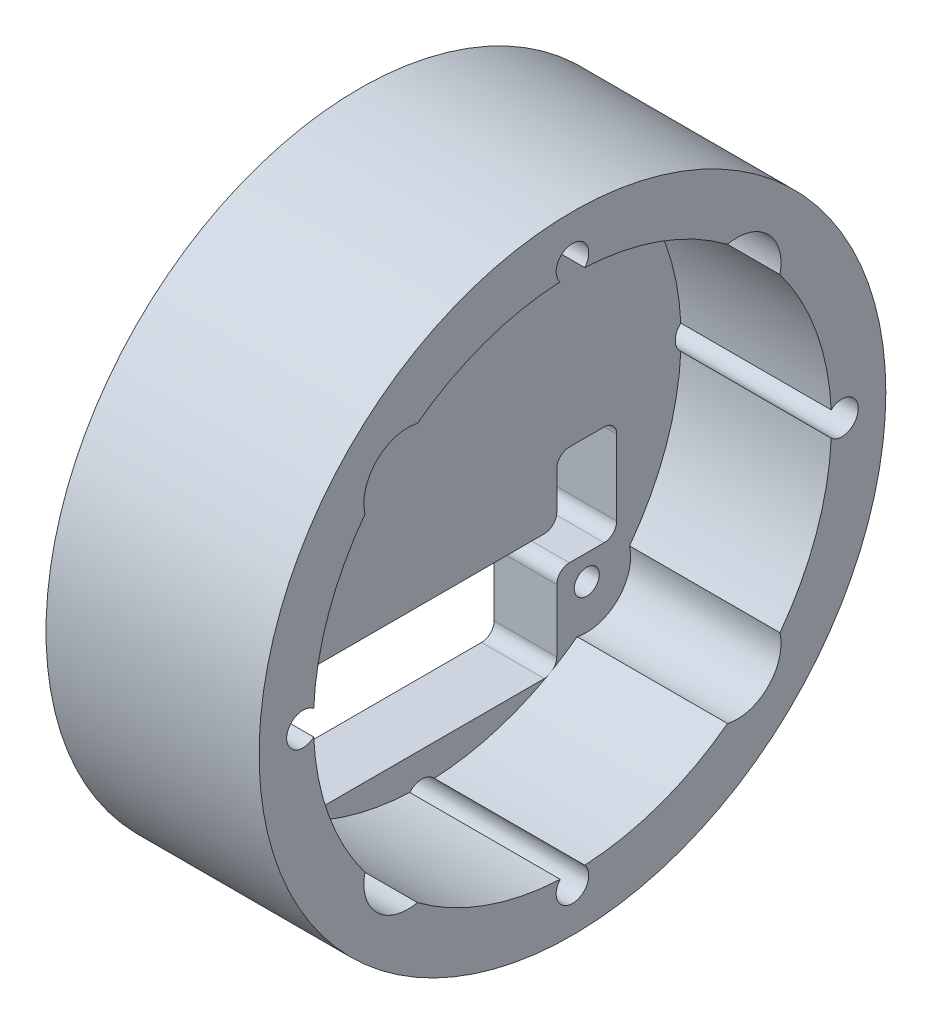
ISO-10303-21;
HEADER;
FILE_DESCRIPTION(('STEP AP214'),'2;1');
FILE_NAME('part.step','',(''),(''),'','','');
FILE_SCHEMA(('AUTOMOTIVE_DESIGN { 1 0 10303 214 1 1 1 1 }'));
ENDSEC;
DATA;
#1=APPLICATION_CONTEXT('core data for automotive mechanical design processes');
#2=APPLICATION_PROTOCOL_DEFINITION('international standard','automotive_design',2000,#1);
#3=PRODUCT_CONTEXT('',#1,'mechanical');
#4=PRODUCT('Part','Part','',(#3));
#5=PRODUCT_RELATED_PRODUCT_CATEGORY('part','',(#4));
#6=PRODUCT_DEFINITION_FORMATION('','',#4);
#7=PRODUCT_DEFINITION_CONTEXT('part definition',#1,'design');
#8=PRODUCT_DEFINITION('design','',#6,#7);
#9=PRODUCT_DEFINITION_SHAPE('','',#8);
#10=(LENGTH_UNIT() NAMED_UNIT(*) SI_UNIT(.MILLI.,.METRE.));
#11=(NAMED_UNIT(*) PLANE_ANGLE_UNIT() SI_UNIT($,.RADIAN.));
#12=(NAMED_UNIT(*) SI_UNIT($,.STERADIAN.) SOLID_ANGLE_UNIT());
#13=UNCERTAINTY_MEASURE_WITH_UNIT(LENGTH_MEASURE(1.E-05),#10,'distance_accuracy_value','');
#14=(GEOMETRIC_REPRESENTATION_CONTEXT(3) GLOBAL_UNCERTAINTY_ASSIGNED_CONTEXT((#13)) GLOBAL_UNIT_ASSIGNED_CONTEXT((#10,
#11,#12)) REPRESENTATION_CONTEXT('',''));
#15=CARTESIAN_POINT('',(0.,0.,0.));
#16=DIRECTION('',(0.,0.,1.));
#17=DIRECTION('',(1.,0.,0.));
#18=AXIS2_PLACEMENT_3D('',#15,#16,#17);
#19=CARTESIAN_POINT('',(17.,0.,0.));
#20=DIRECTION('',(-1.,0.,0.));
#21=DIRECTION('',(0.,0.,1.));
#22=AXIS2_PLACEMENT_3D('',#19,#20,#21);
#23=CYLINDRICAL_SURFACE('',#22,20.6666666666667);
#24=CARTESIAN_POINT('',(17.,0.,0.));
#25=DIRECTION('',(1.,0.,0.));
#26=DIRECTION('',(0.,0.,-1.));
#27=AXIS2_PLACEMENT_3D('',#24,#25,#26);
#28=CIRCLE('',#27,20.6666666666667);
#29=CARTESIAN_POINT('',(17.,0.977973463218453,-20.6435142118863));
#30=VERTEX_POINT('',#29);
#31=CARTESIAN_POINT('',(17.,12.3715848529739,-16.5546065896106));
#32=VERTEX_POINT('',#31);
#33=EDGE_CURVE('E366',#30,#32,#28,.T.);
#34=ORIENTED_EDGE('',*,*,#33,.T.);
#35=DIRECTION('',(-1.,0.,0.));
#36=VECTOR('',#35,1.);
#37=CARTESIAN_POINT('',(11.,12.3715848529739,-16.5546065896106));
#38=LINE('',#37,#36);
#39=CARTESIAN_POINT('',(5.,12.3715848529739,-16.5546065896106));
#40=VERTEX_POINT('',#39);
#41=EDGE_CURVE('E434',#32,#40,#38,.T.);
#42=ORIENTED_EDGE('',*,*,#41,.T.);
#43=CARTESIAN_POINT('',(5.,0.,0.));
#44=DIRECTION('',(1.,0.,0.));
#45=DIRECTION('',(0.,0.,-1.));
#46=AXIS2_PLACEMENT_3D('',#43,#44,#45);
#47=CIRCLE('',#46,20.6666666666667);
#48=CARTESIAN_POINT('',(5.,0.977973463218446,-20.6435142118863));
#49=VERTEX_POINT('',#48);
#50=EDGE_CURVE('E279',#49,#40,#47,.T.);
#51=ORIENTED_EDGE('',*,*,#50,.F.);
#52=DIRECTION('',(1.,0.,0.));
#53=VECTOR('',#52,1.);
#54=CARTESIAN_POINT('',(8.5,0.977973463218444,-20.6435142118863));
#55=LINE('',#54,#53);
#56=EDGE_CURVE('E335',#30,#49,#55,.F.);
#57=ORIENTED_EDGE('',*,*,#56,.F.);
#58=EDGE_LOOP('',(#34,#42,#51,#57));
#59=FACE_BOUND('',#58,.T.);
#60=ADVANCED_FACE('F34',(#59),#23,.F.);
#61=CARTESIAN_POINT('',(5.,16.554606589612,-12.371584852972));
#62=VERTEX_POINT('',#61);
#63=CARTESIAN_POINT('',(5.,20.6435142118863,-0.977973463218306));
#64=VERTEX_POINT('',#63);
#65=EDGE_CURVE('E276',#62,#64,#47,.T.);
#66=ORIENTED_EDGE('',*,*,#65,.F.);
#67=DIRECTION('',(-1.,0.,0.));
#68=VECTOR('',#67,1.);
#69=CARTESIAN_POINT('',(11.,16.554606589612,-12.371584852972));
#70=LINE('',#69,#68);
#71=CARTESIAN_POINT('',(17.,16.554606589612,-12.371584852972));
#72=VERTEX_POINT('',#71);
#73=EDGE_CURVE('E617',#62,#72,#70,.F.);
#74=ORIENTED_EDGE('',*,*,#73,.T.);
#75=CARTESIAN_POINT('',(17.,20.6435142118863,-0.977973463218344));
#76=VERTEX_POINT('',#75);
#77=EDGE_CURVE('E365',#72,#76,#28,.T.);
#78=ORIENTED_EDGE('',*,*,#77,.T.);
#79=DIRECTION('',(1.,0.,0.));
#80=VECTOR('',#79,1.);
#81=CARTESIAN_POINT('',(8.5,20.6435142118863,-0.977973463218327));
#82=LINE('',#81,#80);
#83=EDGE_CURVE('E348',#64,#76,#82,.T.);
#84=ORIENTED_EDGE('',*,*,#83,.F.);
#85=EDGE_LOOP('',(#66,#74,#78,#84));
#86=FACE_BOUND('',#85,.T.);
#87=ADVANCED_FACE('F582',(#86),#23,.F.);
#88=CARTESIAN_POINT('',(17.,-20.6435142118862,-0.9779734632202));
#89=VERTEX_POINT('',#88);
#90=CARTESIAN_POINT('',(17.,-16.5546065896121,-12.3715848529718));
#91=VERTEX_POINT('',#90);
#92=EDGE_CURVE('E364',#89,#91,#28,.T.);
#93=ORIENTED_EDGE('',*,*,#92,.T.);
#94=DIRECTION('',(-1.,0.,0.));
#95=VECTOR('',#94,1.);
#96=CARTESIAN_POINT('',(11.,-16.5546065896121,-12.3715848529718));
#97=LINE('',#96,#95);
#98=CARTESIAN_POINT('',(5.,-16.5546065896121,-12.3715848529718));
#99=VERTEX_POINT('',#98);
#100=EDGE_CURVE('E57',#91,#99,#97,.T.);
#101=ORIENTED_EDGE('',*,*,#100,.T.);
#102=CARTESIAN_POINT('',(5.,-17.7996812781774,-10.5015454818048));
#103=VERTEX_POINT('',#102);
#104=EDGE_CURVE('E283',#103,#99,#47,.T.);
#105=ORIENTED_EDGE('',*,*,#104,.F.);
#106=CARTESIAN_POINT('',(5.,-18.1231214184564,-9.93295430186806));
#107=VERTEX_POINT('',#106);
#108=EDGE_CURVE('E296',#107,#103,#47,.T.);
#109=ORIENTED_EDGE('',*,*,#108,.F.);
#110=CARTESIAN_POINT('',(5.,-20.6435142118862,-0.977973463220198));
#111=VERTEX_POINT('',#110);
#112=EDGE_CURVE('E289',#111,#107,#47,.T.);
#113=ORIENTED_EDGE('',*,*,#112,.F.);
#114=DIRECTION('',(1.,0.,0.));
#115=VECTOR('',#114,1.);
#116=CARTESIAN_POINT('',(8.5,-20.6435142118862,-0.977973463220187));
#117=LINE('',#116,#115);
#118=EDGE_CURVE('E336',#89,#111,#117,.F.);
#119=ORIENTED_EDGE('',*,*,#118,.F.);
#120=EDGE_LOOP('',(#93,#101,#105,#109,#113,#119));
#121=FACE_BOUND('',#120,.T.);
#122=ADVANCED_FACE('F428',(#121),#23,.F.);
#123=CARTESIAN_POINT('',(5.,-12.3715848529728,-16.5546065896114));
#124=VERTEX_POINT('',#123);
#125=CARTESIAN_POINT('',(5.,-0.977973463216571,-20.6435142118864));
#126=VERTEX_POINT('',#125);
#127=EDGE_CURVE('E281',#124,#126,#47,.T.);
#128=ORIENTED_EDGE('',*,*,#127,.F.);
#129=DIRECTION('',(-1.,0.,0.));
#130=VECTOR('',#129,1.);
#131=CARTESIAN_POINT('',(11.,-12.3715848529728,-16.5546065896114));
#132=LINE('',#131,#130);
#133=CARTESIAN_POINT('',(17.,-12.3715848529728,-16.5546065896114));
#134=VERTEX_POINT('',#133);
#135=EDGE_CURVE('E382',#124,#134,#132,.F.);
#136=ORIENTED_EDGE('',*,*,#135,.T.);
#137=CARTESIAN_POINT('',(17.,-0.977973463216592,-20.6435142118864));
#138=VERTEX_POINT('',#137);
#139=EDGE_CURVE('E287',#134,#138,#28,.T.);
#140=ORIENTED_EDGE('',*,*,#139,.T.);
#141=DIRECTION('',(1.,0.,0.));
#142=VECTOR('',#141,1.);
#143=CARTESIAN_POINT('',(8.5,-0.977973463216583,-20.6435142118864));
#144=LINE('',#143,#142);
#145=EDGE_CURVE('E338',#126,#138,#144,.T.);
#146=ORIENTED_EDGE('',*,*,#145,.F.);
#147=EDGE_LOOP('',(#128,#136,#140,#146));
#148=FACE_BOUND('',#147,.T.);
#149=ADVANCED_FACE('F381',(#148),#23,.F.);
#150=CARTESIAN_POINT('',(17.,-0.977973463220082,20.6435142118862));
#151=VERTEX_POINT('',#150);
#152=CARTESIAN_POINT('',(17.,-12.3715848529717,16.5546065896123));
#153=VERTEX_POINT('',#152);
#154=EDGE_CURVE('E363',#151,#153,#28,.T.);
#155=ORIENTED_EDGE('',*,*,#154,.T.);
#156=DIRECTION('',(-1.,0.,0.));
#157=VECTOR('',#156,1.);
#158=CARTESIAN_POINT('',(11.,-12.3715848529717,16.5546065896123));
#159=LINE('',#158,#157);
#160=CARTESIAN_POINT('',(5.,-12.3715848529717,16.5546065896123));
#161=VERTEX_POINT('',#160);
#162=EDGE_CURVE('E49',#153,#161,#159,.T.);
#163=ORIENTED_EDGE('',*,*,#162,.T.);
#164=CARTESIAN_POINT('',(5.,-0.977973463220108,20.6435142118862));
#165=VERTEX_POINT('',#164);
#166=EDGE_CURVE('E280',#165,#161,#47,.T.);
#167=ORIENTED_EDGE('',*,*,#166,.F.);
#168=DIRECTION('',(1.,0.,0.));
#169=VECTOR('',#168,1.);
#170=CARTESIAN_POINT('',(8.5,-0.9779734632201,20.6435142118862));
#171=LINE('',#170,#169);
#172=EDGE_CURVE('E608',#151,#165,#171,.F.);
#173=ORIENTED_EDGE('',*,*,#172,.F.);
#174=EDGE_LOOP('',(#155,#163,#167,#173));
#175=FACE_BOUND('',#174,.T.);
#176=ADVANCED_FACE('F599',(#175),#23,.F.);
#177=CARTESIAN_POINT('',(5.,-16.5546065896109,12.3715848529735));
#178=VERTEX_POINT('',#177);
#179=CARTESIAN_POINT('',(5.,-17.7996812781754,10.501545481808));
#180=VERTEX_POINT('',#179);
#181=EDGE_CURVE('E282',#178,#180,#47,.T.);
#182=ORIENTED_EDGE('',*,*,#181,.F.);
#183=DIRECTION('',(-1.,0.,0.));
#184=VECTOR('',#183,1.);
#185=CARTESIAN_POINT('',(11.,-16.5546065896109,12.3715848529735));
#186=LINE('',#185,#184);
#187=CARTESIAN_POINT('',(17.,-16.5546065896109,12.3715848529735));
#188=VERTEX_POINT('',#187);
#189=EDGE_CURVE('E431',#178,#188,#186,.F.);
#190=ORIENTED_EDGE('',*,*,#189,.T.);
#191=CARTESIAN_POINT('',(17.,-20.6435142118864,0.977973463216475));
#192=VERTEX_POINT('',#191);
#193=EDGE_CURVE('E332',#188,#192,#28,.T.);
#194=ORIENTED_EDGE('',*,*,#193,.T.);
#195=DIRECTION('',(1.,0.,0.));
#196=VECTOR('',#195,1.);
#197=CARTESIAN_POINT('',(8.5,-20.6435142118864,0.977973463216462));
#198=LINE('',#197,#196);
#199=CARTESIAN_POINT('',(5.,-20.6435142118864,0.977973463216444));
#200=VERTEX_POINT('',#199);
#201=EDGE_CURVE('E329',#200,#192,#198,.T.);
#202=ORIENTED_EDGE('',*,*,#201,.F.);
#203=CARTESIAN_POINT('',(5.,-18.1231214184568,9.93295430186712));
#204=VERTEX_POINT('',#203);
#205=EDGE_CURVE('E295',#204,#200,#47,.T.);
#206=ORIENTED_EDGE('',*,*,#205,.F.);
#207=EDGE_CURVE('E293',#180,#204,#47,.T.);
#208=ORIENTED_EDGE('',*,*,#207,.F.);
#209=EDGE_LOOP('',(#182,#190,#194,#202,#206,#208));
#210=FACE_BOUND('',#209,.T.);
#211=ADVANCED_FACE('F327',(#210),#23,.F.);
#212=CARTESIAN_POINT('',(17.,20.6435142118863,0.977973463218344));
#213=VERTEX_POINT('',#212);
#214=CARTESIAN_POINT('',(17.,16.5546065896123,12.3715848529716));
#215=VERTEX_POINT('',#214);
#216=EDGE_CURVE('E270',#213,#215,#28,.T.);
#217=ORIENTED_EDGE('',*,*,#216,.T.);
#218=DIRECTION('',(-1.,0.,0.));
#219=VECTOR('',#218,1.);
#220=CARTESIAN_POINT('',(11.,16.5546065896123,12.3715848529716));
#221=LINE('',#220,#219);
#222=CARTESIAN_POINT('',(5.,16.5546065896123,12.3715848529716));
#223=VERTEX_POINT('',#222);
#224=EDGE_CURVE('E12',#215,#223,#221,.T.);
#225=ORIENTED_EDGE('',*,*,#224,.T.);
#226=CARTESIAN_POINT('',(5.,20.6435142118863,0.97797346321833));
#227=VERTEX_POINT('',#226);
#228=EDGE_CURVE('E268',#227,#223,#47,.T.);
#229=ORIENTED_EDGE('',*,*,#228,.F.);
#230=DIRECTION('',(1.,0.,0.));
#231=VECTOR('',#230,1.);
#232=CARTESIAN_POINT('',(8.5,20.6435142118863,0.977973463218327));
#233=LINE('',#232,#231);
#234=EDGE_CURVE('E346',#213,#227,#233,.F.);
#235=ORIENTED_EDGE('',*,*,#234,.F.);
#236=EDGE_LOOP('',(#217,#225,#229,#235));
#237=FACE_BOUND('',#236,.T.);
#238=ADVANCED_FACE('F266',(#237),#23,.F.);
#239=CARTESIAN_POINT('',(5.,12.3715848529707,16.554606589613));
#240=VERTEX_POINT('',#239);
#241=CARTESIAN_POINT('',(5.,0.977973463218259,20.6435142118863));
#242=VERTEX_POINT('',#241);
#243=EDGE_CURVE('E277',#240,#242,#47,.T.);
#244=ORIENTED_EDGE('',*,*,#243,.F.);
#245=DIRECTION('',(-1.,0.,0.));
#246=VECTOR('',#245,1.);
#247=CARTESIAN_POINT('',(11.,12.3715848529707,16.554606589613));
#248=LINE('',#247,#246);
#249=CARTESIAN_POINT('',(17.,12.3715848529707,16.554606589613));
#250=VERTEX_POINT('',#249);
#251=EDGE_CURVE('E42',#240,#250,#248,.F.);
#252=ORIENTED_EDGE('',*,*,#251,.T.);
#253=CARTESIAN_POINT('',(17.,0.977973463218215,20.6435142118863));
#254=VERTEX_POINT('',#253);
#255=EDGE_CURVE('E354',#250,#254,#28,.T.);
#256=ORIENTED_EDGE('',*,*,#255,.T.);
#257=DIRECTION('',(1.,0.,0.));
#258=VECTOR('',#257,1.);
#259=CARTESIAN_POINT('',(8.5,0.977973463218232,20.6435142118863));
#260=LINE('',#259,#258);
#261=EDGE_CURVE('E340',#242,#254,#260,.T.);
#262=ORIENTED_EDGE('',*,*,#261,.F.);
#263=EDGE_LOOP('',(#244,#252,#256,#262));
#264=FACE_BOUND('',#263,.T.);
#265=ADVANCED_FACE('F352',(#264),#23,.F.);
#266=CARTESIAN_POINT('',(5.,0.,0.));
#267=DIRECTION('',(1.,0.,0.));
#268=DIRECTION('',(0.,0.,-1.));
#269=AXIS2_PLACEMENT_3D('',#266,#267,#268);
#270=PLANE('',#269);
#271=CARTESIAN_POINT('',(5.,-17.14,-9.74999999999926));
#272=DIRECTION('',(1.,0.,0.));
#273=DIRECTION('',(0.,0.,1.));
#274=AXIS2_PLACEMENT_3D('',#271,#272,#273);
#275=CIRCLE('',#274,1.);
#276=CARTESIAN_POINT('',(5.,-18.14,-9.74999999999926));
#277=VERTEX_POINT('',#276);
#278=EDGE_CURVE('E520',#277,#107,#275,.T.);
#279=ORIENTED_EDGE('',*,*,#278,.F.);
#280=DIRECTION('',(0.,0.,-1.));
#281=VECTOR('',#280,1.);
#282=CARTESIAN_POINT('',(5.,-18.14,-9.74999999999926));
#283=LINE('',#282,#281);
#284=CARTESIAN_POINT('',(5.,-18.14,9.75000000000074));
#285=VERTEX_POINT('',#284);
#286=EDGE_CURVE('E324',#285,#277,#283,.T.);
#287=ORIENTED_EDGE('',*,*,#286,.F.);
#288=CARTESIAN_POINT('',(5.,-17.14,9.75000000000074));
#289=DIRECTION('',(1.,0.,0.));
#290=DIRECTION('',(0.,0.,1.));
#291=AXIS2_PLACEMENT_3D('',#288,#289,#290);
#292=CIRCLE('',#291,1.);
#293=EDGE_CURVE('E314',#204,#285,#292,.T.);
#294=ORIENTED_EDGE('',*,*,#293,.F.);
#295=ORIENTED_EDGE('',*,*,#205,.T.);
#296=CARTESIAN_POINT('',(5.,-21.5,-1.93919588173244E-12));
#297=DIRECTION('',(1.,0.,0.));
#298=DIRECTION('',(0.,0.,-1.));
#299=AXIS2_PLACEMENT_3D('',#296,#297,#298);
#300=CIRCLE('',#299,1.3);
#301=EDGE_CURVE('E416',#111,#200,#300,.T.);
#302=ORIENTED_EDGE('',*,*,#301,.F.);
#303=ORIENTED_EDGE('',*,*,#112,.T.);
#304=EDGE_LOOP('',(#279,#287,#294,#295,#302,#303));
#305=FACE_BOUND('',#304,.T.);
#306=ADVANCED_FACE('F321',(#305),#270,.T.);
#307=CARTESIAN_POINT('',(5.,13.1400000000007,13.1400000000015));
#308=DIRECTION('',(1.,0.,0.));
#309=DIRECTION('',(0.,0.,-1.));
#310=AXIS2_PLACEMENT_3D('',#307,#308,#309);
#311=CIRCLE('',#310,3.50000000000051);
#312=EDGE_CURVE('E254',#223,#240,#311,.T.);
#313=ORIENTED_EDGE('',*,*,#312,.T.);
#314=ORIENTED_EDGE('',*,*,#243,.T.);
#315=CARTESIAN_POINT('',(5.,-9.72230931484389E-13,21.499999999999));
#316=DIRECTION('',(1.,0.,0.));
#317=DIRECTION('',(0.,0.,-1.));
#318=AXIS2_PLACEMENT_3D('',#315,#316,#317);
#319=CIRCLE('',#318,1.3);
#320=EDGE_CURVE('E413',#165,#242,#319,.T.);
#321=ORIENTED_EDGE('',*,*,#320,.F.);
#322=ORIENTED_EDGE('',*,*,#166,.T.);
#323=CARTESIAN_POINT('',(5.,-13.1399999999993,13.1400000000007));
#324=DIRECTION('',(1.,0.,0.));
#325=DIRECTION('',(0.,0.,-1.));
#326=AXIS2_PLACEMENT_3D('',#323,#324,#325);
#327=CIRCLE('',#326,3.49999999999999);
#328=EDGE_CURVE('E261',#161,#178,#327,.T.);
#329=ORIENTED_EDGE('',*,*,#328,.T.);
#330=ORIENTED_EDGE('',*,*,#181,.T.);
#331=CARTESIAN_POINT('',(5.,-17.14,10.7500000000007));
#332=VERTEX_POINT('',#331);
#333=EDGE_CURVE('E318',#332,#180,#292,.T.);
#334=ORIENTED_EDGE('',*,*,#333,.F.);
#335=DIRECTION('',(0.,-1.,0.));
#336=VECTOR('',#335,1.);
#337=CARTESIAN_POINT('',(5.,-9.14,10.7500000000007));
#338=LINE('',#337,#336);
#339=CARTESIAN_POINT('',(5.,-9.14,10.7500000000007));
#340=VERTEX_POINT('',#339);
#341=EDGE_CURVE('E325',#340,#332,#338,.T.);
#342=ORIENTED_EDGE('',*,*,#341,.F.);
#343=CARTESIAN_POINT('',(5.,-9.14,9.75000000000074));
#344=DIRECTION('',(1.,0.,0.));
#345=DIRECTION('',(0.,0.,1.));
#346=AXIS2_PLACEMENT_3D('',#343,#344,#345);
#347=CIRCLE('',#346,0.999999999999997);
#348=CARTESIAN_POINT('',(5.,-8.14,9.75000000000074));
#349=VERTEX_POINT('',#348);
#350=EDGE_CURVE('E515',#349,#340,#347,.T.);
#351=ORIENTED_EDGE('',*,*,#350,.F.);
#352=DIRECTION('',(0.,0.,1.));
#353=VECTOR('',#352,1.);
#354=CARTESIAN_POINT('',(5.,-8.14,-9.74999999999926));
#355=LINE('',#354,#353);
#356=CARTESIAN_POINT('',(5.,-8.14,-9.74999999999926));
#357=VERTEX_POINT('',#356);
#358=EDGE_CURVE('E513',#357,#349,#355,.T.);
#359=ORIENTED_EDGE('',*,*,#358,.F.);
#360=CARTESIAN_POINT('',(5.,-7.14,-9.74999999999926));
#361=DIRECTION('',(-1.,0.,0.));
#362=DIRECTION('',(0.,0.,-1.));
#363=AXIS2_PLACEMENT_3D('',#360,#361,#362);
#364=CIRCLE('',#363,1.);
#365=CARTESIAN_POINT('',(5.,-7.14,-10.7499999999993));
#366=VERTEX_POINT('',#365);
#367=EDGE_CURVE('E510',#366,#357,#364,.T.);
#368=ORIENTED_EDGE('',*,*,#367,.F.);
#369=DIRECTION('',(0.,-1.,0.));
#370=VECTOR('',#369,1.);
#371=CARTESIAN_POINT('',(5.,-4.14,-10.7499999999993));
#372=LINE('',#371,#370);
#373=CARTESIAN_POINT('',(5.,-4.14,-10.7499999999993));
#374=VERTEX_POINT('',#373);
#375=EDGE_CURVE('E508',#374,#366,#372,.T.);
#376=ORIENTED_EDGE('',*,*,#375,.F.);
#377=CARTESIAN_POINT('',(5.,-4.14,-11.7499999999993));
#378=DIRECTION('',(1.,0.,0.));
#379=DIRECTION('',(0.,0.,1.));
#380=AXIS2_PLACEMENT_3D('',#377,#378,#379);
#381=CIRCLE('',#380,1.);
#382=CARTESIAN_POINT('',(5.,-3.14,-11.7499999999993));
#383=VERTEX_POINT('',#382);
#384=EDGE_CURVE('E505',#383,#374,#381,.T.);
#385=ORIENTED_EDGE('',*,*,#384,.F.);
#386=DIRECTION('',(0.,0.,1.));
#387=VECTOR('',#386,1.);
#388=CARTESIAN_POINT('',(5.,-3.14,-14.5299999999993));
#389=LINE('',#388,#387);
#390=CARTESIAN_POINT('',(5.,-3.14,-14.5299999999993));
#391=VERTEX_POINT('',#390);
#392=EDGE_CURVE('E502',#391,#383,#389,.T.);
#393=ORIENTED_EDGE('',*,*,#392,.F.);
#394=CARTESIAN_POINT('',(5.,-4.14,-14.5299999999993));
#395=DIRECTION('',(1.,0.,0.));
#396=DIRECTION('',(0.,0.,-1.));
#397=AXIS2_PLACEMENT_3D('',#394,#395,#396);
#398=CIRCLE('',#397,1.);
#399=CARTESIAN_POINT('',(5.,-4.14,-15.5299999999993));
#400=VERTEX_POINT('',#399);
#401=EDGE_CURVE('E499',#400,#391,#398,.T.);
#402=ORIENTED_EDGE('',*,*,#401,.F.);
#403=DIRECTION('',(0.,1.,0.));
#404=VECTOR('',#403,1.);
#405=CARTESIAN_POINT('',(5.,-4.14,-15.5299999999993));
#406=LINE('',#405,#404);
#407=CARTESIAN_POINT('',(5.,-10.14,-15.5299999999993));
#408=VERTEX_POINT('',#407);
#409=EDGE_CURVE('E496',#408,#400,#406,.T.);
#410=ORIENTED_EDGE('',*,*,#409,.F.);
#411=CARTESIAN_POINT('',(5.,-10.14,-14.5299999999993));
#412=DIRECTION('',(1.,0.,0.));
#413=DIRECTION('',(0.,0.,1.));
#414=AXIS2_PLACEMENT_3D('',#411,#412,#413);
#415=CIRCLE('',#414,0.999999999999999);
#416=CARTESIAN_POINT('',(5.,-11.14,-14.5299999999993));
#417=VERTEX_POINT('',#416);
#418=EDGE_CURVE('E494',#417,#408,#415,.T.);
#419=ORIENTED_EDGE('',*,*,#418,.F.);
#420=DIRECTION('',(0.,0.,-1.));
#421=VECTOR('',#420,1.);
#422=CARTESIAN_POINT('',(5.,-11.14,-14.5299999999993));
#423=LINE('',#422,#421);
#424=CARTESIAN_POINT('',(5.,-11.14,-11.7499999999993));
#425=VERTEX_POINT('',#424);
#426=EDGE_CURVE('E491',#425,#417,#423,.T.);
#427=ORIENTED_EDGE('',*,*,#426,.F.);
#428=CARTESIAN_POINT('',(5.,-12.14,-11.7499999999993));
#429=DIRECTION('',(-1.,0.,0.));
#430=DIRECTION('',(0.,0.,-1.));
#431=AXIS2_PLACEMENT_3D('',#428,#429,#430);
#432=CIRCLE('',#431,0.999999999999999);
#433=CARTESIAN_POINT('',(5.,-12.14,-10.7499999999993));
#434=VERTEX_POINT('',#433);
#435=EDGE_CURVE('E439',#434,#425,#432,.T.);
#436=ORIENTED_EDGE('',*,*,#435,.F.);
#437=DIRECTION('',(0.,1.,0.));
#438=VECTOR('',#437,1.);
#439=CARTESIAN_POINT('',(5.,-12.14,-10.7499999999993));
#440=LINE('',#439,#438);
#441=CARTESIAN_POINT('',(5.,-17.14,-10.7499999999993));
#442=VERTEX_POINT('',#441);
#443=EDGE_CURVE('E444',#442,#434,#440,.T.);
#444=ORIENTED_EDGE('',*,*,#443,.F.);
#445=EDGE_CURVE('E425',#103,#442,#275,.T.);
#446=ORIENTED_EDGE('',*,*,#445,.F.);
#447=ORIENTED_EDGE('',*,*,#104,.T.);
#448=CARTESIAN_POINT('',(5.,-13.14,-13.1399999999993));
#449=DIRECTION('',(1.,0.,0.));
#450=DIRECTION('',(0.,0.,-1.));
#451=AXIS2_PLACEMENT_3D('',#448,#449,#450);
#452=CIRCLE('',#451,3.50000000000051);
#453=EDGE_CURVE('E423',#99,#124,#452,.T.);
#454=ORIENTED_EDGE('',*,*,#453,.T.);
#455=ORIENTED_EDGE('',*,*,#127,.T.);
#456=CARTESIAN_POINT('',(5.,9.69597940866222E-13,-21.500000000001));
#457=DIRECTION('',(1.,0.,0.));
#458=DIRECTION('',(0.,0.,-1.));
#459=AXIS2_PLACEMENT_3D('',#456,#457,#458);
#460=CIRCLE('',#459,1.3);
#461=EDGE_CURVE('E391',#49,#126,#460,.T.);
#462=ORIENTED_EDGE('',*,*,#461,.F.);
#463=ORIENTED_EDGE('',*,*,#50,.T.);
#464=CARTESIAN_POINT('',(5.,13.14,-13.1399999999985));
#465=DIRECTION('',(1.,0.,0.));
#466=DIRECTION('',(0.,0.,-1.));
#467=AXIS2_PLACEMENT_3D('',#464,#465,#466);
#468=CIRCLE('',#467,3.5000000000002);
#469=EDGE_CURVE('E614',#40,#62,#468,.T.);
#470=ORIENTED_EDGE('',*,*,#469,.T.);
#471=ORIENTED_EDGE('',*,*,#65,.T.);
#472=CARTESIAN_POINT('',(5.,21.5,0.));
#473=DIRECTION('',(1.,0.,0.));
#474=DIRECTION('',(0.,0.,-1.));
#475=AXIS2_PLACEMENT_3D('',#472,#473,#474);
#476=CIRCLE('',#475,1.3);
#477=EDGE_CURVE('E275',#227,#64,#476,.T.);
#478=ORIENTED_EDGE('',*,*,#477,.F.);
#479=ORIENTED_EDGE('',*,*,#228,.T.);
#480=EDGE_LOOP('',(#313,#314,#321,#322,#329,#330,#334,#342,#351,#359,#368,#376,#385,#393,#402,
#410,#419,#427,#436,#444,#446,#447,#454,#455,#462,#463,#470,#471,#478,#479));
#481=FACE_BOUND('',#480,.T.);
#482=CARTESIAN_POINT('',(5.,13.14,-13.14));
#483=DIRECTION('',(-1.,0.,0.));
#484=DIRECTION('',(0.,0.,1.));
#485=AXIS2_PLACEMENT_3D('',#482,#483,#484);
#486=CIRCLE('',#485,1.);
#487=CARTESIAN_POINT('',(5.,13.14,-12.14));
#488=VERTEX_POINT('',#487);
#489=EDGE_CURVE('E788',#488,#488,#486,.T.);
#490=ORIENTED_EDGE('',*,*,#489,.T.);
#491=EDGE_LOOP('',(#490));
#492=FACE_BOUND('',#491,.T.);
#493=CARTESIAN_POINT('',(5.,13.1400000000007,13.14));
#494=DIRECTION('',(-1.,0.,0.));
#495=DIRECTION('',(0.,0.,1.));
#496=AXIS2_PLACEMENT_3D('',#493,#494,#495);
#497=CIRCLE('',#496,1.00000000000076);
#498=CARTESIAN_POINT('',(5.,13.1400000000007,14.1400000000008));
#499=VERTEX_POINT('',#498);
#500=EDGE_CURVE('E794',#499,#499,#497,.T.);
#501=ORIENTED_EDGE('',*,*,#500,.T.);
#502=EDGE_LOOP('',(#501));
#503=FACE_BOUND('',#502,.T.);
#504=CARTESIAN_POINT('',(5.,-13.1399999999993,13.1400000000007));
#505=DIRECTION('',(-1.,0.,0.));
#506=DIRECTION('',(0.,0.,1.));
#507=AXIS2_PLACEMENT_3D('',#504,#505,#506);
#508=CIRCLE('',#507,1.00000000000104);
#509=CARTESIAN_POINT('',(5.,-13.1399999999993,14.1400000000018));
#510=VERTEX_POINT('',#509);
#511=EDGE_CURVE('E801',#510,#510,#508,.T.);
#512=ORIENTED_EDGE('',*,*,#511,.T.);
#513=EDGE_LOOP('',(#512));
#514=FACE_BOUND('',#513,.T.);
#515=CARTESIAN_POINT('',(5.,-13.14,-13.1399999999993));
#516=DIRECTION('',(-1.,0.,0.));
#517=DIRECTION('',(0.,0.,1.));
#518=AXIS2_PLACEMENT_3D('',#515,#516,#517);
#519=CIRCLE('',#518,1.00000000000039);
#520=CARTESIAN_POINT('',(5.,-13.14,-12.1399999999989));
#521=VERTEX_POINT('',#520);
#522=EDGE_CURVE('E797',#521,#521,#519,.T.);
#523=ORIENTED_EDGE('',*,*,#522,.T.);
#524=EDGE_LOOP('',(#523));
#525=FACE_BOUND('',#524,.T.);
#526=ADVANCED_FACE('F272',(#481,#492,#503,#514,#525),#270,.T.);
#527=CARTESIAN_POINT('',(5.,0.,0.));
#528=DIRECTION('',(-1.,0.,0.));
#529=DIRECTION('',(0.,0.,1.));
#530=AXIS2_PLACEMENT_3D('',#527,#528,#529);
#531=CYLINDRICAL_SURFACE('',#530,25.);
#532=CARTESIAN_POINT('',(0.,0.,0.));
#533=DIRECTION('',(1.,0.,0.));
#534=DIRECTION('',(0.,0.,-1.));
#535=AXIS2_PLACEMENT_3D('',#532,#533,#534);
#536=CIRCLE('',#535,25.);
#537=CARTESIAN_POINT('',(0.,0.,-25.));
#538=VERTEX_POINT('',#537);
#539=EDGE_CURVE('E787',#538,#538,#536,.T.);
#540=ORIENTED_EDGE('',*,*,#539,.T.);
#541=EDGE_LOOP('',(#540));
#542=FACE_BOUND('',#541,.T.);
#543=CARTESIAN_POINT('',(17.,0.,0.));
#544=DIRECTION('',(1.,0.,0.));
#545=DIRECTION('',(0.,0.,-1.));
#546=AXIS2_PLACEMENT_3D('',#543,#544,#545);
#547=CIRCLE('',#546,25.);
#548=CARTESIAN_POINT('',(17.,0.,-25.));
#549=VERTEX_POINT('',#548);
#550=EDGE_CURVE('E375',#549,#549,#547,.T.);
#551=ORIENTED_EDGE('',*,*,#550,.F.);
#552=EDGE_LOOP('',(#551));
#553=FACE_BOUND('',#552,.T.);
#554=ADVANCED_FACE('F36',(#542,#553),#531,.T.);
#555=CARTESIAN_POINT('',(0.,0.,0.));
#556=DIRECTION('',(1.,0.,0.));
#557=DIRECTION('',(0.,0.,-1.));
#558=AXIS2_PLACEMENT_3D('',#555,#556,#557);
#559=PLANE('',#558);
#560=DIRECTION('',(0.,1.,0.));
#561=VECTOR('',#560,1.);
#562=CARTESIAN_POINT('',(0.,-12.14,-10.7499999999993));
#563=LINE('',#562,#561);
#564=CARTESIAN_POINT('',(0.,-17.14,-10.7499999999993));
#565=VERTEX_POINT('',#564);
#566=CARTESIAN_POINT('',(0.,-12.14,-10.7499999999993));
#567=VERTEX_POINT('',#566);
#568=EDGE_CURVE('E486',#565,#567,#563,.T.);
#569=ORIENTED_EDGE('',*,*,#568,.T.);
#570=CARTESIAN_POINT('',(0.,-12.14,-11.7499999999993));
#571=DIRECTION('',(-1.,0.,0.));
#572=DIRECTION('',(0.,0.,-1.));
#573=AXIS2_PLACEMENT_3D('',#570,#571,#572);
#574=CIRCLE('',#573,0.999999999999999);
#575=CARTESIAN_POINT('',(0.,-11.14,-11.7499999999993));
#576=VERTEX_POINT('',#575);
#577=EDGE_CURVE('E440',#567,#576,#574,.T.);
#578=ORIENTED_EDGE('',*,*,#577,.T.);
#579=DIRECTION('',(0.,0.,-1.));
#580=VECTOR('',#579,1.);
#581=CARTESIAN_POINT('',(0.,-11.14,-14.5299999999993));
#582=LINE('',#581,#580);
#583=CARTESIAN_POINT('',(0.,-11.14,-14.5299999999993));
#584=VERTEX_POINT('',#583);
#585=EDGE_CURVE('E443',#576,#584,#582,.T.);
#586=ORIENTED_EDGE('',*,*,#585,.T.);
#587=CARTESIAN_POINT('',(0.,-10.14,-14.5299999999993));
#588=DIRECTION('',(1.,0.,0.));
#589=DIRECTION('',(0.,0.,1.));
#590=AXIS2_PLACEMENT_3D('',#587,#588,#589);
#591=CIRCLE('',#590,0.999999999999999);
#592=CARTESIAN_POINT('',(0.,-10.14,-15.5299999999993));
#593=VERTEX_POINT('',#592);
#594=EDGE_CURVE('E447',#584,#593,#591,.T.);
#595=ORIENTED_EDGE('',*,*,#594,.T.);
#596=DIRECTION('',(0.,1.,0.));
#597=VECTOR('',#596,1.);
#598=CARTESIAN_POINT('',(0.,-4.14,-15.5299999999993));
#599=LINE('',#598,#597);
#600=CARTESIAN_POINT('',(0.,-4.14,-15.5299999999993));
#601=VERTEX_POINT('',#600);
#602=EDGE_CURVE('E450',#593,#601,#599,.T.);
#603=ORIENTED_EDGE('',*,*,#602,.T.);
#604=CARTESIAN_POINT('',(0.,-4.14,-14.5299999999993));
#605=DIRECTION('',(1.,0.,0.));
#606=DIRECTION('',(0.,0.,-1.));
#607=AXIS2_PLACEMENT_3D('',#604,#605,#606);
#608=CIRCLE('',#607,1.);
#609=CARTESIAN_POINT('',(0.,-3.14,-14.5299999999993));
#610=VERTEX_POINT('',#609);
#611=EDGE_CURVE('E453',#601,#610,#608,.T.);
#612=ORIENTED_EDGE('',*,*,#611,.T.);
#613=DIRECTION('',(0.,0.,1.));
#614=VECTOR('',#613,1.);
#615=CARTESIAN_POINT('',(0.,-3.14,-14.5299999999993));
#616=LINE('',#615,#614);
#617=CARTESIAN_POINT('',(0.,-3.14,-11.7499999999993));
#618=VERTEX_POINT('',#617);
#619=EDGE_CURVE('E456',#610,#618,#616,.T.);
#620=ORIENTED_EDGE('',*,*,#619,.T.);
#621=CARTESIAN_POINT('',(0.,-4.14,-11.7499999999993));
#622=DIRECTION('',(1.,0.,0.));
#623=DIRECTION('',(0.,0.,1.));
#624=AXIS2_PLACEMENT_3D('',#621,#622,#623);
#625=CIRCLE('',#624,1.);
#626=CARTESIAN_POINT('',(0.,-4.14,-10.7499999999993));
#627=VERTEX_POINT('',#626);
#628=EDGE_CURVE('E459',#618,#627,#625,.T.);
#629=ORIENTED_EDGE('',*,*,#628,.T.);
#630=DIRECTION('',(0.,-1.,0.));
#631=VECTOR('',#630,1.);
#632=CARTESIAN_POINT('',(0.,-4.14,-10.7499999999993));
#633=LINE('',#632,#631);
#634=CARTESIAN_POINT('',(0.,-7.14,-10.7499999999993));
#635=VERTEX_POINT('',#634);
#636=EDGE_CURVE('E462',#627,#635,#633,.T.);
#637=ORIENTED_EDGE('',*,*,#636,.T.);
#638=CARTESIAN_POINT('',(0.,-7.14,-9.74999999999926));
#639=DIRECTION('',(-1.,0.,0.));
#640=DIRECTION('',(0.,0.,-1.));
#641=AXIS2_PLACEMENT_3D('',#638,#639,#640);
#642=CIRCLE('',#641,1.);
#643=CARTESIAN_POINT('',(0.,-8.14,-9.74999999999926));
#644=VERTEX_POINT('',#643);
#645=EDGE_CURVE('E465',#635,#644,#642,.T.);
#646=ORIENTED_EDGE('',*,*,#645,.T.);
#647=DIRECTION('',(0.,0.,1.));
#648=VECTOR('',#647,1.);
#649=CARTESIAN_POINT('',(0.,-8.14,-9.74999999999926));
#650=LINE('',#649,#648);
#651=CARTESIAN_POINT('',(0.,-8.14,9.75000000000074));
#652=VERTEX_POINT('',#651);
#653=EDGE_CURVE('E468',#644,#652,#650,.T.);
#654=ORIENTED_EDGE('',*,*,#653,.T.);
#655=CARTESIAN_POINT('',(0.,-9.14,9.75000000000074));
#656=DIRECTION('',(1.,0.,0.));
#657=DIRECTION('',(0.,0.,1.));
#658=AXIS2_PLACEMENT_3D('',#655,#656,#657);
#659=CIRCLE('',#658,0.999999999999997);
#660=CARTESIAN_POINT('',(0.,-9.14,10.7500000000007));
#661=VERTEX_POINT('',#660);
#662=EDGE_CURVE('E471',#652,#661,#659,.T.);
#663=ORIENTED_EDGE('',*,*,#662,.T.);
#664=DIRECTION('',(0.,-1.,0.));
#665=VECTOR('',#664,1.);
#666=CARTESIAN_POINT('',(0.,-9.14,10.7500000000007));
#667=LINE('',#666,#665);
#668=CARTESIAN_POINT('',(0.,-17.14,10.7500000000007));
#669=VERTEX_POINT('',#668);
#670=EDGE_CURVE('E474',#661,#669,#667,.T.);
#671=ORIENTED_EDGE('',*,*,#670,.T.);
#672=CARTESIAN_POINT('',(0.,-17.14,9.75000000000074));
#673=DIRECTION('',(1.,0.,0.));
#674=DIRECTION('',(0.,0.,1.));
#675=AXIS2_PLACEMENT_3D('',#672,#673,#674);
#676=CIRCLE('',#675,1.);
#677=CARTESIAN_POINT('',(0.,-18.14,9.75000000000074));
#678=VERTEX_POINT('',#677);
#679=EDGE_CURVE('E477',#669,#678,#676,.T.);
#680=ORIENTED_EDGE('',*,*,#679,.T.);
#681=DIRECTION('',(0.,0.,-1.));
#682=VECTOR('',#681,1.);
#683=CARTESIAN_POINT('',(0.,-18.14,-9.74999999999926));
#684=LINE('',#683,#682);
#685=CARTESIAN_POINT('',(0.,-18.14,-9.74999999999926));
#686=VERTEX_POINT('',#685);
#687=EDGE_CURVE('E480',#678,#686,#684,.T.);
#688=ORIENTED_EDGE('',*,*,#687,.T.);
#689=CARTESIAN_POINT('',(0.,-17.14,-9.74999999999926));
#690=DIRECTION('',(1.,0.,0.));
#691=DIRECTION('',(0.,0.,1.));
#692=AXIS2_PLACEMENT_3D('',#689,#690,#691);
#693=CIRCLE('',#692,1.);
#694=EDGE_CURVE('E483',#686,#565,#693,.T.);
#695=ORIENTED_EDGE('',*,*,#694,.T.);
#696=EDGE_LOOP('',(#569,#578,#586,#595,#603,#612,#620,#629,#637,#646,#654,#663,#671,#680,#688,#695));
#697=FACE_BOUND('',#696,.T.);
#698=CARTESIAN_POINT('',(0.,21.5,0.));
#699=DIRECTION('',(1.,0.,0.));
#700=DIRECTION('',(0.,0.,-1.));
#701=AXIS2_PLACEMENT_3D('',#698,#699,#700);
#702=CIRCLE('',#701,1.3);
#703=CARTESIAN_POINT('',(0.,21.5,-1.3));
#704=VERTEX_POINT('',#703);
#705=EDGE_CURVE('E404',#704,#704,#702,.T.);
#706=ORIENTED_EDGE('',*,*,#705,.T.);
#707=EDGE_LOOP('',(#706));
#708=FACE_BOUND('',#707,.T.);
#709=CARTESIAN_POINT('',(0.,9.69597940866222E-13,-21.500000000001));
#710=DIRECTION('',(1.,0.,0.));
#711=DIRECTION('',(0.,0.,-1.));
#712=AXIS2_PLACEMENT_3D('',#709,#710,#711);
#713=CIRCLE('',#712,1.3);
#714=CARTESIAN_POINT('',(0.,9.69597940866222E-13,-22.800000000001));
#715=VERTEX_POINT('',#714);
#716=EDGE_CURVE('E394',#715,#715,#713,.T.);
#717=ORIENTED_EDGE('',*,*,#716,.T.);
#718=EDGE_LOOP('',(#717));
#719=FACE_BOUND('',#718,.T.);
#720=CARTESIAN_POINT('',(0.,-21.5,-1.93919588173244E-12));
#721=DIRECTION('',(1.,0.,0.));
#722=DIRECTION('',(0.,0.,-1.));
#723=AXIS2_PLACEMENT_3D('',#720,#721,#722);
#724=CIRCLE('',#723,1.3);
#725=CARTESIAN_POINT('',(0.,-21.5,-1.30000000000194));
#726=VERTEX_POINT('',#725);
#727=EDGE_CURVE('E395',#726,#726,#724,.T.);
#728=ORIENTED_EDGE('',*,*,#727,.T.);
#729=EDGE_LOOP('',(#728));
#730=FACE_BOUND('',#729,.T.);
#731=CARTESIAN_POINT('',(0.,-9.72230931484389E-13,21.499999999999));
#732=DIRECTION('',(1.,0.,0.));
#733=DIRECTION('',(0.,0.,-1.));
#734=AXIS2_PLACEMENT_3D('',#731,#732,#733);
#735=CIRCLE('',#734,1.3);
#736=CARTESIAN_POINT('',(0.,-9.72230931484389E-13,20.199999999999));
#737=VERTEX_POINT('',#736);
#738=EDGE_CURVE('E407',#737,#737,#735,.T.);
#739=ORIENTED_EDGE('',*,*,#738,.T.);
#740=EDGE_LOOP('',(#739));
#741=FACE_BOUND('',#740,.T.);
#742=CARTESIAN_POINT('',(0.,-13.14,-13.1399999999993));
#743=DIRECTION('',(-1.,0.,0.));
#744=DIRECTION('',(0.,0.,1.));
#745=AXIS2_PLACEMENT_3D('',#742,#743,#744);
#746=CIRCLE('',#745,1.00000000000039);
#747=CARTESIAN_POINT('',(0.,-13.14,-12.1399999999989));
#748=VERTEX_POINT('',#747);
#749=EDGE_CURVE('E772',#748,#748,#746,.T.);
#750=ORIENTED_EDGE('',*,*,#749,.F.);
#751=EDGE_LOOP('',(#750));
#752=FACE_BOUND('',#751,.T.);
#753=CARTESIAN_POINT('',(0.,-13.1399999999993,13.1400000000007));
#754=DIRECTION('',(-1.,0.,0.));
#755=DIRECTION('',(0.,0.,1.));
#756=AXIS2_PLACEMENT_3D('',#753,#754,#755);
#757=CIRCLE('',#756,1.00000000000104);
#758=CARTESIAN_POINT('',(0.,-13.1399999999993,14.1400000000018));
#759=VERTEX_POINT('',#758);
#760=EDGE_CURVE('E776',#759,#759,#757,.T.);
#761=ORIENTED_EDGE('',*,*,#760,.F.);
#762=EDGE_LOOP('',(#761));
#763=FACE_BOUND('',#762,.T.);
#764=CARTESIAN_POINT('',(0.,13.1400000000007,13.14));
#765=DIRECTION('',(-1.,0.,0.));
#766=DIRECTION('',(0.,0.,1.));
#767=AXIS2_PLACEMENT_3D('',#764,#765,#766);
#768=CIRCLE('',#767,1.00000000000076);
#769=CARTESIAN_POINT('',(0.,13.1400000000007,14.1400000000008));
#770=VERTEX_POINT('',#769);
#771=EDGE_CURVE('E780',#770,#770,#768,.T.);
#772=ORIENTED_EDGE('',*,*,#771,.F.);
#773=EDGE_LOOP('',(#772));
#774=FACE_BOUND('',#773,.T.);
#775=CARTESIAN_POINT('',(0.,13.14,-13.14));
#776=DIRECTION('',(-1.,0.,0.));
#777=DIRECTION('',(0.,0.,1.));
#778=AXIS2_PLACEMENT_3D('',#775,#776,#777);
#779=CIRCLE('',#778,1.);
#780=CARTESIAN_POINT('',(0.,13.14,-12.14));
#781=VERTEX_POINT('',#780);
#782=EDGE_CURVE('E784',#781,#781,#779,.T.);
#783=ORIENTED_EDGE('',*,*,#782,.F.);
#784=EDGE_LOOP('',(#783));
#785=FACE_BOUND('',#784,.T.);
#786=ORIENTED_EDGE('',*,*,#539,.F.);
#787=EDGE_LOOP('',(#786));
#788=FACE_BOUND('',#787,.T.);
#789=ADVANCED_FACE('F564',(#697,#708,#719,#730,#741,#752,#763,#774,#785,#788),#559,.F.);
#790=CARTESIAN_POINT('',(5.,13.14,-13.14));
#791=DIRECTION('',(-1.,0.,0.));
#792=DIRECTION('',(0.,0.,1.));
#793=AXIS2_PLACEMENT_3D('',#790,#791,#792);
#794=CYLINDRICAL_SURFACE('',#793,1.);
#795=ORIENTED_EDGE('',*,*,#489,.F.);
#796=EDGE_LOOP('',(#795));
#797=FACE_BOUND('',#796,.T.);
#798=ORIENTED_EDGE('',*,*,#782,.T.);
#799=EDGE_LOOP('',(#798));
#800=FACE_BOUND('',#799,.T.);
#801=ADVANCED_FACE('F734',(#797,#800),#794,.F.);
#802=CARTESIAN_POINT('',(5.,13.1400000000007,13.14));
#803=DIRECTION('',(-1.,0.,0.));
#804=DIRECTION('',(0.,0.,1.));
#805=AXIS2_PLACEMENT_3D('',#802,#803,#804);
#806=CYLINDRICAL_SURFACE('',#805,1.00000000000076);
#807=ORIENTED_EDGE('',*,*,#500,.F.);
#808=EDGE_LOOP('',(#807));
#809=FACE_BOUND('',#808,.T.);
#810=ORIENTED_EDGE('',*,*,#771,.T.);
#811=EDGE_LOOP('',(#810));
#812=FACE_BOUND('',#811,.T.);
#813=ADVANCED_FACE('F739',(#809,#812),#806,.F.);
#814=CARTESIAN_POINT('',(5.,-13.1399999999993,13.1400000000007));
#815=DIRECTION('',(-1.,0.,0.));
#816=DIRECTION('',(0.,0.,1.));
#817=AXIS2_PLACEMENT_3D('',#814,#815,#816);
#818=CYLINDRICAL_SURFACE('',#817,1.00000000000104);
#819=ORIENTED_EDGE('',*,*,#511,.F.);
#820=EDGE_LOOP('',(#819));
#821=FACE_BOUND('',#820,.T.);
#822=ORIENTED_EDGE('',*,*,#760,.T.);
#823=EDGE_LOOP('',(#822));
#824=FACE_BOUND('',#823,.T.);
#825=ADVANCED_FACE('F748',(#821,#824),#818,.F.);
#826=CARTESIAN_POINT('',(5.,-13.14,-13.1399999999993));
#827=DIRECTION('',(-1.,0.,0.));
#828=DIRECTION('',(0.,0.,1.));
#829=AXIS2_PLACEMENT_3D('',#826,#827,#828);
#830=CYLINDRICAL_SURFACE('',#829,1.00000000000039);
#831=ORIENTED_EDGE('',*,*,#522,.F.);
#832=EDGE_LOOP('',(#831));
#833=FACE_BOUND('',#832,.T.);
#834=ORIENTED_EDGE('',*,*,#749,.T.);
#835=EDGE_LOOP('',(#834));
#836=FACE_BOUND('',#835,.T.);
#837=ADVANCED_FACE('F745',(#833,#836),#830,.F.);
#838=CARTESIAN_POINT('',(17.,0.,0.));
#839=DIRECTION('',(1.,0.,0.));
#840=DIRECTION('',(0.,0.,-1.));
#841=AXIS2_PLACEMENT_3D('',#838,#839,#840);
#842=PLANE('',#841);
#843=ORIENTED_EDGE('',*,*,#255,.F.);
#844=CARTESIAN_POINT('',(17.,13.1400000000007,13.1400000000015));
#845=DIRECTION('',(1.,0.,0.));
#846=DIRECTION('',(0.,0.,-1.));
#847=AXIS2_PLACEMENT_3D('',#844,#845,#846);
#848=CIRCLE('',#847,3.50000000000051);
#849=EDGE_CURVE('E360',#215,#250,#848,.T.);
#850=ORIENTED_EDGE('',*,*,#849,.F.);
#851=ORIENTED_EDGE('',*,*,#216,.F.);
#852=CARTESIAN_POINT('',(17.,21.5,0.));
#853=DIRECTION('',(1.,0.,0.));
#854=DIRECTION('',(0.,0.,-1.));
#855=AXIS2_PLACEMENT_3D('',#852,#853,#854);
#856=CIRCLE('',#855,1.3);
#857=EDGE_CURVE('E398',#76,#213,#856,.T.);
#858=ORIENTED_EDGE('',*,*,#857,.F.);
#859=ORIENTED_EDGE('',*,*,#77,.F.);
#860=CARTESIAN_POINT('',(17.,13.14,-13.1399999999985));
#861=DIRECTION('',(1.,0.,0.));
#862=DIRECTION('',(0.,0.,-1.));
#863=AXIS2_PLACEMENT_3D('',#860,#861,#862);
#864=CIRCLE('',#863,3.5000000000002);
#865=EDGE_CURVE('E612',#32,#72,#864,.T.);
#866=ORIENTED_EDGE('',*,*,#865,.F.);
#867=ORIENTED_EDGE('',*,*,#33,.F.);
#868=CARTESIAN_POINT('',(17.,9.69597940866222E-13,-21.500000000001));
#869=DIRECTION('',(1.,0.,0.));
#870=DIRECTION('',(0.,0.,-1.));
#871=AXIS2_PLACEMENT_3D('',#868,#869,#870);
#872=CIRCLE('',#871,1.3);
#873=EDGE_CURVE('E388',#138,#30,#872,.T.);
#874=ORIENTED_EDGE('',*,*,#873,.F.);
#875=ORIENTED_EDGE('',*,*,#139,.F.);
#876=CARTESIAN_POINT('',(17.,-13.14,-13.1399999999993));
#877=DIRECTION('',(1.,0.,0.));
#878=DIRECTION('',(0.,0.,-1.));
#879=AXIS2_PLACEMENT_3D('',#876,#877,#878);
#880=CIRCLE('',#879,3.50000000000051);
#881=EDGE_CURVE('E610',#91,#134,#880,.T.);
#882=ORIENTED_EDGE('',*,*,#881,.F.);
#883=ORIENTED_EDGE('',*,*,#92,.F.);
#884=CARTESIAN_POINT('',(17.,-21.5,-1.93919588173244E-12));
#885=DIRECTION('',(1.,0.,0.));
#886=DIRECTION('',(0.,0.,-1.));
#887=AXIS2_PLACEMENT_3D('',#884,#885,#886);
#888=CIRCLE('',#887,1.3);
#889=EDGE_CURVE('E401',#192,#89,#888,.T.);
#890=ORIENTED_EDGE('',*,*,#889,.F.);
#891=ORIENTED_EDGE('',*,*,#193,.F.);
#892=CARTESIAN_POINT('',(17.,-13.1399999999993,13.1400000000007));
#893=DIRECTION('',(1.,0.,0.));
#894=DIRECTION('',(0.,0.,-1.));
#895=AXIS2_PLACEMENT_3D('',#892,#893,#894);
#896=CIRCLE('',#895,3.49999999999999);
#897=EDGE_CURVE('E609',#153,#188,#896,.T.);
#898=ORIENTED_EDGE('',*,*,#897,.F.);
#899=ORIENTED_EDGE('',*,*,#154,.F.);
#900=CARTESIAN_POINT('',(17.,-9.72230931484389E-13,21.499999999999));
#901=DIRECTION('',(1.,0.,0.));
#902=DIRECTION('',(0.,0.,-1.));
#903=AXIS2_PLACEMENT_3D('',#900,#901,#902);
#904=CIRCLE('',#903,1.3);
#905=EDGE_CURVE('E362',#254,#151,#904,.T.);
#906=ORIENTED_EDGE('',*,*,#905,.F.);
#907=EDGE_LOOP('',(#843,#850,#851,#858,#859,#866,#867,#874,#875,#882,#883,#890,#891,#898,#899,#906));
#908=FACE_BOUND('',#907,.T.);
#909=ORIENTED_EDGE('',*,*,#550,.T.);
#910=EDGE_LOOP('',(#909));
#911=FACE_BOUND('',#910,.T.);
#912=ADVANCED_FACE('F358',(#908,#911),#842,.T.);
#913=CARTESIAN_POINT('',(0.,-9.72230931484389E-13,21.499999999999));
#914=DIRECTION('',(1.,0.,0.));
#915=DIRECTION('',(0.,0.,-1.));
#916=AXIS2_PLACEMENT_3D('',#913,#914,#915);
#917=CYLINDRICAL_SURFACE('',#916,1.3);
#918=ORIENTED_EDGE('',*,*,#261,.T.);
#919=ORIENTED_EDGE('',*,*,#905,.T.);
#920=ORIENTED_EDGE('',*,*,#172,.T.);
#921=ORIENTED_EDGE('',*,*,#320,.T.);
#922=EDGE_LOOP('',(#918,#919,#920,#921));
#923=FACE_BOUND('',#922,.T.);
#924=ORIENTED_EDGE('',*,*,#738,.F.);
#925=EDGE_LOOP('',(#924));
#926=FACE_BOUND('',#925,.T.);
#927=ADVANCED_FACE('F756',(#923,#926),#917,.F.);
#928=CARTESIAN_POINT('',(0.,-21.5,-1.93919588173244E-12));
#929=DIRECTION('',(1.,0.,0.));
#930=DIRECTION('',(0.,0.,-1.));
#931=AXIS2_PLACEMENT_3D('',#928,#929,#930);
#932=CYLINDRICAL_SURFACE('',#931,1.3);
#933=ORIENTED_EDGE('',*,*,#201,.T.);
#934=ORIENTED_EDGE('',*,*,#889,.T.);
#935=ORIENTED_EDGE('',*,*,#118,.T.);
#936=ORIENTED_EDGE('',*,*,#301,.T.);
#937=EDGE_LOOP('',(#933,#934,#935,#936));
#938=FACE_BOUND('',#937,.T.);
#939=ORIENTED_EDGE('',*,*,#727,.F.);
#940=EDGE_LOOP('',(#939));
#941=FACE_BOUND('',#940,.T.);
#942=ADVANCED_FACE('F578',(#938,#941),#932,.F.);
#943=CARTESIAN_POINT('',(0.,9.69597940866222E-13,-21.500000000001));
#944=DIRECTION('',(1.,0.,0.));
#945=DIRECTION('',(0.,0.,-1.));
#946=AXIS2_PLACEMENT_3D('',#943,#944,#945);
#947=CYLINDRICAL_SURFACE('',#946,1.3);
#948=ORIENTED_EDGE('',*,*,#145,.T.);
#949=ORIENTED_EDGE('',*,*,#873,.T.);
#950=ORIENTED_EDGE('',*,*,#56,.T.);
#951=ORIENTED_EDGE('',*,*,#461,.T.);
#952=EDGE_LOOP('',(#948,#949,#950,#951));
#953=FACE_BOUND('',#952,.T.);
#954=ORIENTED_EDGE('',*,*,#716,.F.);
#955=EDGE_LOOP('',(#954));
#956=FACE_BOUND('',#955,.T.);
#957=ADVANCED_FACE('F386',(#953,#956),#947,.F.);
#958=CARTESIAN_POINT('',(0.,21.5,0.));
#959=DIRECTION('',(1.,0.,0.));
#960=DIRECTION('',(0.,0.,-1.));
#961=AXIS2_PLACEMENT_3D('',#958,#959,#960);
#962=CYLINDRICAL_SURFACE('',#961,1.3);
#963=ORIENTED_EDGE('',*,*,#83,.T.);
#964=ORIENTED_EDGE('',*,*,#857,.T.);
#965=ORIENTED_EDGE('',*,*,#234,.T.);
#966=ORIENTED_EDGE('',*,*,#477,.T.);
#967=EDGE_LOOP('',(#963,#964,#965,#966));
#968=FACE_BOUND('',#967,.T.);
#969=ORIENTED_EDGE('',*,*,#705,.F.);
#970=EDGE_LOOP('',(#969));
#971=FACE_BOUND('',#970,.T.);
#972=ADVANCED_FACE('F567',(#968,#971),#962,.F.);
#973=CARTESIAN_POINT('',(5.,-12.14,-11.7499999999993));
#974=DIRECTION('',(1.,0.,0.));
#975=DIRECTION('',(0.,0.,-1.));
#976=AXIS2_PLACEMENT_3D('',#973,#974,#975);
#977=PLANE('',#976);
#978=ORIENTED_EDGE('',*,*,#108,.T.);
#979=EDGE_CURVE('E523',#107,#103,#275,.T.);
#980=ORIENTED_EDGE('',*,*,#979,.F.);
#981=EDGE_LOOP('',(#978,#980));
#982=FACE_BOUND('',#981,.T.);
#983=ADVANCED_FACE('F569',(#982),#977,.F.);
#984=CARTESIAN_POINT('',(0.,-12.14,-11.7499999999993));
#985=DIRECTION('',(1.,0.,0.));
#986=DIRECTION('',(0.,0.,-1.));
#987=AXIS2_PLACEMENT_3D('',#984,#985,#986);
#988=CYLINDRICAL_SURFACE('',#987,0.999999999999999);
#989=ORIENTED_EDGE('',*,*,#435,.T.);
#990=DIRECTION('',(1.,0.,0.));
#991=VECTOR('',#990,1.);
#992=CARTESIAN_POINT('',(0.,-11.14,-11.7499999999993));
#993=LINE('',#992,#991);
#994=EDGE_CURVE('E489',#576,#425,#993,.T.);
#995=ORIENTED_EDGE('',*,*,#994,.F.);
#996=ORIENTED_EDGE('',*,*,#577,.F.);
#997=DIRECTION('',(1.,0.,0.));
#998=VECTOR('',#997,1.);
#999=CARTESIAN_POINT('',(0.,-12.14,-10.7499999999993));
#1000=LINE('',#999,#998);
#1001=EDGE_CURVE('E410',#567,#434,#1000,.T.);
#1002=ORIENTED_EDGE('',*,*,#1001,.T.);
#1003=EDGE_LOOP('',(#989,#995,#996,#1002));
#1004=FACE_BOUND('',#1003,.T.);
#1005=ADVANCED_FACE('F575',(#1004),#988,.T.);
#1006=CARTESIAN_POINT('',(0.,-12.14,-10.7499999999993));
#1007=DIRECTION('',(0.,0.,-1.));
#1008=DIRECTION('',(-1.,0.,0.));
#1009=AXIS2_PLACEMENT_3D('',#1006,#1007,#1008);
#1010=PLANE('',#1009);
#1011=ORIENTED_EDGE('',*,*,#443,.T.);
#1012=ORIENTED_EDGE('',*,*,#1001,.F.);
#1013=ORIENTED_EDGE('',*,*,#568,.F.);
#1014=DIRECTION('',(1.,0.,0.));
#1015=VECTOR('',#1014,1.);
#1016=CARTESIAN_POINT('',(0.,-17.14,-10.7499999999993));
#1017=LINE('',#1016,#1015);
#1018=EDGE_CURVE('E527',#565,#442,#1017,.T.);
#1019=ORIENTED_EDGE('',*,*,#1018,.T.);
#1020=EDGE_LOOP('',(#1011,#1012,#1013,#1019));
#1021=FACE_BOUND('',#1020,.T.);
#1022=ADVANCED_FACE('F643',(#1021),#1010,.F.);
#1023=CARTESIAN_POINT('',(0.,-17.14,-9.74999999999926));
#1024=DIRECTION('',(1.,0.,0.));
#1025=DIRECTION('',(0.,0.,-1.));
#1026=AXIS2_PLACEMENT_3D('',#1023,#1024,#1025);
#1027=CYLINDRICAL_SURFACE('',#1026,1.);
#1028=ORIENTED_EDGE('',*,*,#278,.T.);
#1029=ORIENTED_EDGE('',*,*,#979,.T.);
#1030=ORIENTED_EDGE('',*,*,#445,.T.);
#1031=ORIENTED_EDGE('',*,*,#1018,.F.);
#1032=ORIENTED_EDGE('',*,*,#694,.F.);
#1033=DIRECTION('',(1.,0.,0.));
#1034=VECTOR('',#1033,1.);
#1035=CARTESIAN_POINT('',(0.,-18.14,-9.74999999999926));
#1036=LINE('',#1035,#1034);
#1037=EDGE_CURVE('E530',#686,#277,#1036,.T.);
#1038=ORIENTED_EDGE('',*,*,#1037,.T.);
#1039=EDGE_LOOP('',(#1028,#1029,#1030,#1031,#1032,#1038));
#1040=FACE_BOUND('',#1039,.T.);
#1041=ADVANCED_FACE('F646',(#1040),#1027,.F.);
#1042=CARTESIAN_POINT('',(0.,-18.14,-9.74999999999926));
#1043=DIRECTION('',(0.,-1.,0.));
#1044=DIRECTION('',(0.,0.,-1.));
#1045=AXIS2_PLACEMENT_3D('',#1042,#1043,#1044);
#1046=PLANE('',#1045);
#1047=ORIENTED_EDGE('',*,*,#286,.T.);
#1048=ORIENTED_EDGE('',*,*,#1037,.F.);
#1049=ORIENTED_EDGE('',*,*,#687,.F.);
#1050=DIRECTION('',(1.,0.,0.));
#1051=VECTOR('',#1050,1.);
#1052=CARTESIAN_POINT('',(0.,-18.14,9.75000000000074));
#1053=LINE('',#1052,#1051);
#1054=EDGE_CURVE('E532',#678,#285,#1053,.T.);
#1055=ORIENTED_EDGE('',*,*,#1054,.T.);
#1056=EDGE_LOOP('',(#1047,#1048,#1049,#1055));
#1057=FACE_BOUND('',#1056,.T.);
#1058=ADVANCED_FACE('F650',(#1057),#1046,.F.);
#1059=CARTESIAN_POINT('',(0.,-17.14,9.75000000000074));
#1060=DIRECTION('',(1.,0.,0.));
#1061=DIRECTION('',(0.,0.,-1.));
#1062=AXIS2_PLACEMENT_3D('',#1059,#1060,#1061);
#1063=CYLINDRICAL_SURFACE('',#1062,1.);
#1064=ORIENTED_EDGE('',*,*,#333,.T.);
#1065=EDGE_CURVE('E306',#180,#204,#292,.T.);
#1066=ORIENTED_EDGE('',*,*,#1065,.T.);
#1067=ORIENTED_EDGE('',*,*,#293,.T.);
#1068=ORIENTED_EDGE('',*,*,#1054,.F.);
#1069=ORIENTED_EDGE('',*,*,#679,.F.);
#1070=DIRECTION('',(1.,0.,0.));
#1071=VECTOR('',#1070,1.);
#1072=CARTESIAN_POINT('',(0.,-17.14,10.7500000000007));
#1073=LINE('',#1072,#1071);
#1074=EDGE_CURVE('E534',#669,#332,#1073,.T.);
#1075=ORIENTED_EDGE('',*,*,#1074,.T.);
#1076=EDGE_LOOP('',(#1064,#1066,#1067,#1068,#1069,#1075));
#1077=FACE_BOUND('',#1076,.T.);
#1078=ADVANCED_FACE('F313',(#1077),#1063,.F.);
#1079=CARTESIAN_POINT('',(0.,-9.14,10.7500000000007));
#1080=DIRECTION('',(0.,0.,1.));
#1081=DIRECTION('',(0.,-1.,0.));
#1082=AXIS2_PLACEMENT_3D('',#1079,#1080,#1081);
#1083=PLANE('',#1082);
#1084=ORIENTED_EDGE('',*,*,#341,.T.);
#1085=ORIENTED_EDGE('',*,*,#1074,.F.);
#1086=ORIENTED_EDGE('',*,*,#670,.F.);
#1087=DIRECTION('',(1.,0.,0.));
#1088=VECTOR('',#1087,1.);
#1089=CARTESIAN_POINT('',(0.,-9.14,10.7500000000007));
#1090=LINE('',#1089,#1088);
#1091=EDGE_CURVE('E536',#661,#340,#1090,.T.);
#1092=ORIENTED_EDGE('',*,*,#1091,.T.);
#1093=EDGE_LOOP('',(#1084,#1085,#1086,#1092));
#1094=FACE_BOUND('',#1093,.T.);
#1095=ADVANCED_FACE('F657',(#1094),#1083,.F.);
#1096=CARTESIAN_POINT('',(0.,-9.14,9.75000000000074));
#1097=DIRECTION('',(1.,0.,0.));
#1098=DIRECTION('',(0.,0.,-1.));
#1099=AXIS2_PLACEMENT_3D('',#1096,#1097,#1098);
#1100=CYLINDRICAL_SURFACE('',#1099,0.999999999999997);
#1101=ORIENTED_EDGE('',*,*,#350,.T.);
#1102=ORIENTED_EDGE('',*,*,#1091,.F.);
#1103=ORIENTED_EDGE('',*,*,#662,.F.);
#1104=DIRECTION('',(1.,0.,0.));
#1105=VECTOR('',#1104,1.);
#1106=CARTESIAN_POINT('',(0.,-8.14,9.75000000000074));
#1107=LINE('',#1106,#1105);
#1108=EDGE_CURVE('E538',#652,#349,#1107,.T.);
#1109=ORIENTED_EDGE('',*,*,#1108,.T.);
#1110=EDGE_LOOP('',(#1101,#1102,#1103,#1109));
#1111=FACE_BOUND('',#1110,.T.);
#1112=ADVANCED_FACE('F660',(#1111),#1100,.F.);
#1113=CARTESIAN_POINT('',(0.,-8.14,-9.74999999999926));
#1114=DIRECTION('',(0.,1.,0.));
#1115=DIRECTION('',(0.,0.,1.));
#1116=AXIS2_PLACEMENT_3D('',#1113,#1114,#1115);
#1117=PLANE('',#1116);
#1118=ORIENTED_EDGE('',*,*,#358,.T.);
#1119=ORIENTED_EDGE('',*,*,#1108,.F.);
#1120=ORIENTED_EDGE('',*,*,#653,.F.);
#1121=DIRECTION('',(1.,0.,0.));
#1122=VECTOR('',#1121,1.);
#1123=CARTESIAN_POINT('',(0.,-8.14,-9.74999999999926));
#1124=LINE('',#1123,#1122);
#1125=EDGE_CURVE('E541',#644,#357,#1124,.T.);
#1126=ORIENTED_EDGE('',*,*,#1125,.T.);
#1127=EDGE_LOOP('',(#1118,#1119,#1120,#1126));
#1128=FACE_BOUND('',#1127,.T.);
#1129=ADVANCED_FACE('F664',(#1128),#1117,.F.);
#1130=CARTESIAN_POINT('',(0.,-7.14,-9.74999999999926));
#1131=DIRECTION('',(1.,0.,0.));
#1132=DIRECTION('',(0.,0.,-1.));
#1133=AXIS2_PLACEMENT_3D('',#1130,#1131,#1132);
#1134=CYLINDRICAL_SURFACE('',#1133,1.);
#1135=ORIENTED_EDGE('',*,*,#367,.T.);
#1136=ORIENTED_EDGE('',*,*,#1125,.F.);
#1137=ORIENTED_EDGE('',*,*,#645,.F.);
#1138=DIRECTION('',(1.,0.,0.));
#1139=VECTOR('',#1138,1.);
#1140=CARTESIAN_POINT('',(0.,-7.14,-10.7499999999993));
#1141=LINE('',#1140,#1139);
#1142=EDGE_CURVE('E543',#635,#366,#1141,.T.);
#1143=ORIENTED_EDGE('',*,*,#1142,.T.);
#1144=EDGE_LOOP('',(#1135,#1136,#1137,#1143));
#1145=FACE_BOUND('',#1144,.T.);
#1146=ADVANCED_FACE('F668',(#1145),#1134,.T.);
#1147=CARTESIAN_POINT('',(0.,-4.14,-10.7499999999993));
#1148=DIRECTION('',(0.,0.,1.));
#1149=DIRECTION('',(0.,-1.,0.));
#1150=AXIS2_PLACEMENT_3D('',#1147,#1148,#1149);
#1151=PLANE('',#1150);
#1152=ORIENTED_EDGE('',*,*,#375,.T.);
#1153=ORIENTED_EDGE('',*,*,#1142,.F.);
#1154=ORIENTED_EDGE('',*,*,#636,.F.);
#1155=DIRECTION('',(1.,0.,0.));
#1156=VECTOR('',#1155,1.);
#1157=CARTESIAN_POINT('',(0.,-4.14,-10.7499999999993));
#1158=LINE('',#1157,#1156);
#1159=EDGE_CURVE('E546',#627,#374,#1158,.T.);
#1160=ORIENTED_EDGE('',*,*,#1159,.T.);
#1161=EDGE_LOOP('',(#1152,#1153,#1154,#1160));
#1162=FACE_BOUND('',#1161,.T.);
#1163=ADVANCED_FACE('F672',(#1162),#1151,.F.);
#1164=CARTESIAN_POINT('',(0.,-4.14,-11.7499999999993));
#1165=DIRECTION('',(1.,0.,0.));
#1166=DIRECTION('',(0.,0.,-1.));
#1167=AXIS2_PLACEMENT_3D('',#1164,#1165,#1166);
#1168=CYLINDRICAL_SURFACE('',#1167,1.);
#1169=ORIENTED_EDGE('',*,*,#384,.T.);
#1170=ORIENTED_EDGE('',*,*,#1159,.F.);
#1171=ORIENTED_EDGE('',*,*,#628,.F.);
#1172=DIRECTION('',(1.,0.,0.));
#1173=VECTOR('',#1172,1.);
#1174=CARTESIAN_POINT('',(0.,-3.14,-11.7499999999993));
#1175=LINE('',#1174,#1173);
#1176=EDGE_CURVE('E548',#618,#383,#1175,.T.);
#1177=ORIENTED_EDGE('',*,*,#1176,.T.);
#1178=EDGE_LOOP('',(#1169,#1170,#1171,#1177));
#1179=FACE_BOUND('',#1178,.T.);
#1180=ADVANCED_FACE('F676',(#1179),#1168,.F.);
#1181=CARTESIAN_POINT('',(0.,-3.14,-14.5299999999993));
#1182=DIRECTION('',(0.,1.,0.));
#1183=DIRECTION('',(0.,0.,1.));
#1184=AXIS2_PLACEMENT_3D('',#1181,#1182,#1183);
#1185=PLANE('',#1184);
#1186=ORIENTED_EDGE('',*,*,#392,.T.);
#1187=ORIENTED_EDGE('',*,*,#1176,.F.);
#1188=ORIENTED_EDGE('',*,*,#619,.F.);
#1189=DIRECTION('',(1.,0.,0.));
#1190=VECTOR('',#1189,1.);
#1191=CARTESIAN_POINT('',(0.,-3.14,-14.5299999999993));
#1192=LINE('',#1191,#1190);
#1193=EDGE_CURVE('E550',#610,#391,#1192,.T.);
#1194=ORIENTED_EDGE('',*,*,#1193,.T.);
#1195=EDGE_LOOP('',(#1186,#1187,#1188,#1194));
#1196=FACE_BOUND('',#1195,.T.);
#1197=ADVANCED_FACE('F680',(#1196),#1185,.F.);
#1198=CARTESIAN_POINT('',(0.,-4.14,-14.5299999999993));
#1199=DIRECTION('',(1.,0.,0.));
#1200=DIRECTION('',(0.,0.,-1.));
#1201=AXIS2_PLACEMENT_3D('',#1198,#1199,#1200);
#1202=CYLINDRICAL_SURFACE('',#1201,1.);
#1203=ORIENTED_EDGE('',*,*,#401,.T.);
#1204=ORIENTED_EDGE('',*,*,#1193,.F.);
#1205=ORIENTED_EDGE('',*,*,#611,.F.);
#1206=DIRECTION('',(1.,0.,0.));
#1207=VECTOR('',#1206,1.);
#1208=CARTESIAN_POINT('',(0.,-4.14,-15.5299999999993));
#1209=LINE('',#1208,#1207);
#1210=EDGE_CURVE('E552',#601,#400,#1209,.T.);
#1211=ORIENTED_EDGE('',*,*,#1210,.T.);
#1212=EDGE_LOOP('',(#1203,#1204,#1205,#1211));
#1213=FACE_BOUND('',#1212,.T.);
#1214=ADVANCED_FACE('F684',(#1213),#1202,.F.);
#1215=CARTESIAN_POINT('',(0.,-4.14,-15.5299999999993));
#1216=DIRECTION('',(0.,0.,-1.));
#1217=DIRECTION('',(-1.,0.,0.));
#1218=AXIS2_PLACEMENT_3D('',#1215,#1216,#1217);
#1219=PLANE('',#1218);
#1220=ORIENTED_EDGE('',*,*,#409,.T.);
#1221=ORIENTED_EDGE('',*,*,#1210,.F.);
#1222=ORIENTED_EDGE('',*,*,#602,.F.);
#1223=DIRECTION('',(1.,0.,0.));
#1224=VECTOR('',#1223,1.);
#1225=CARTESIAN_POINT('',(0.,-10.14,-15.5299999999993));
#1226=LINE('',#1225,#1224);
#1227=EDGE_CURVE('E554',#593,#408,#1226,.T.);
#1228=ORIENTED_EDGE('',*,*,#1227,.T.);
#1229=EDGE_LOOP('',(#1220,#1221,#1222,#1228));
#1230=FACE_BOUND('',#1229,.T.);
#1231=ADVANCED_FACE('F688',(#1230),#1219,.F.);
#1232=CARTESIAN_POINT('',(0.,-10.14,-14.5299999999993));
#1233=DIRECTION('',(1.,0.,0.));
#1234=DIRECTION('',(0.,0.,-1.));
#1235=AXIS2_PLACEMENT_3D('',#1232,#1233,#1234);
#1236=CYLINDRICAL_SURFACE('',#1235,0.999999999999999);
#1237=ORIENTED_EDGE('',*,*,#418,.T.);
#1238=ORIENTED_EDGE('',*,*,#1227,.F.);
#1239=ORIENTED_EDGE('',*,*,#594,.F.);
#1240=DIRECTION('',(1.,0.,0.));
#1241=VECTOR('',#1240,1.);
#1242=CARTESIAN_POINT('',(0.,-11.14,-14.5299999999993));
#1243=LINE('',#1242,#1241);
#1244=EDGE_CURVE('E557',#584,#417,#1243,.T.);
#1245=ORIENTED_EDGE('',*,*,#1244,.T.);
#1246=EDGE_LOOP('',(#1237,#1238,#1239,#1245));
#1247=FACE_BOUND('',#1246,.T.);
#1248=ADVANCED_FACE('F692',(#1247),#1236,.F.);
#1249=CARTESIAN_POINT('',(0.,-11.14,-14.5299999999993));
#1250=DIRECTION('',(0.,-1.,0.));
#1251=DIRECTION('',(0.,0.,-1.));
#1252=AXIS2_PLACEMENT_3D('',#1249,#1250,#1251);
#1253=PLANE('',#1252);
#1254=ORIENTED_EDGE('',*,*,#426,.T.);
#1255=ORIENTED_EDGE('',*,*,#1244,.F.);
#1256=ORIENTED_EDGE('',*,*,#585,.F.);
#1257=ORIENTED_EDGE('',*,*,#994,.T.);
#1258=EDGE_LOOP('',(#1254,#1255,#1256,#1257));
#1259=FACE_BOUND('',#1258,.T.);
#1260=ADVANCED_FACE('F642',(#1259),#1253,.F.);
#1261=ORIENTED_EDGE('',*,*,#207,.T.);
#1262=ORIENTED_EDGE('',*,*,#1065,.F.);
#1263=EDGE_LOOP('',(#1261,#1262));
#1264=FACE_BOUND('',#1263,.T.);
#1265=ADVANCED_FACE('F305',(#1264),#977,.F.);
#1266=CARTESIAN_POINT('',(17.,13.1400000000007,13.1400000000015));
#1267=DIRECTION('',(-1.,0.,0.));
#1268=DIRECTION('',(0.,0.,1.));
#1269=AXIS2_PLACEMENT_3D('',#1266,#1267,#1268);
#1270=CYLINDRICAL_SURFACE('',#1269,3.50000000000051);
#1271=ORIENTED_EDGE('',*,*,#849,.T.);
#1272=ORIENTED_EDGE('',*,*,#251,.F.);
#1273=ORIENTED_EDGE('',*,*,#312,.F.);
#1274=ORIENTED_EDGE('',*,*,#224,.F.);
#1275=EDGE_LOOP('',(#1271,#1272,#1273,#1274));
#1276=FACE_BOUND('',#1275,.T.);
#1277=ADVANCED_FACE('F255',(#1276),#1270,.F.);
#1278=CARTESIAN_POINT('',(17.,13.14,-13.1399999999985));
#1279=DIRECTION('',(-1.,0.,0.));
#1280=DIRECTION('',(0.,0.,1.));
#1281=AXIS2_PLACEMENT_3D('',#1278,#1279,#1280);
#1282=CYLINDRICAL_SURFACE('',#1281,3.5000000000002);
#1283=ORIENTED_EDGE('',*,*,#865,.T.);
#1284=ORIENTED_EDGE('',*,*,#73,.F.);
#1285=ORIENTED_EDGE('',*,*,#469,.F.);
#1286=ORIENTED_EDGE('',*,*,#41,.F.);
#1287=EDGE_LOOP('',(#1283,#1284,#1285,#1286));
#1288=FACE_BOUND('',#1287,.T.);
#1289=ADVANCED_FACE('F627',(#1288),#1282,.F.);
#1290=CARTESIAN_POINT('',(17.,-13.14,-13.1399999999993));
#1291=DIRECTION('',(-1.,0.,0.));
#1292=DIRECTION('',(0.,0.,1.));
#1293=AXIS2_PLACEMENT_3D('',#1290,#1291,#1292);
#1294=CYLINDRICAL_SURFACE('',#1293,3.50000000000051);
#1295=ORIENTED_EDGE('',*,*,#881,.T.);
#1296=ORIENTED_EDGE('',*,*,#135,.F.);
#1297=ORIENTED_EDGE('',*,*,#453,.F.);
#1298=ORIENTED_EDGE('',*,*,#100,.F.);
#1299=EDGE_LOOP('',(#1295,#1296,#1297,#1298));
#1300=FACE_BOUND('',#1299,.T.);
#1301=ADVANCED_FACE('F629',(#1300),#1294,.F.);
#1302=CARTESIAN_POINT('',(17.,-13.1399999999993,13.1400000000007));
#1303=DIRECTION('',(-1.,0.,0.));
#1304=DIRECTION('',(0.,0.,1.));
#1305=AXIS2_PLACEMENT_3D('',#1302,#1303,#1304);
#1306=CYLINDRICAL_SURFACE('',#1305,3.49999999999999);
#1307=ORIENTED_EDGE('',*,*,#897,.T.);
#1308=ORIENTED_EDGE('',*,*,#189,.F.);
#1309=ORIENTED_EDGE('',*,*,#328,.F.);
#1310=ORIENTED_EDGE('',*,*,#162,.F.);
#1311=EDGE_LOOP('',(#1307,#1308,#1309,#1310));
#1312=FACE_BOUND('',#1311,.T.);
#1313=ADVANCED_FACE('F635',(#1312),#1306,.F.);
#1314=CLOSED_SHELL('',(#60,#87,#122,#149,#176,#211,#238,#265,#306,#526,#554,#789,#801,#813,#825,
#837,#912,#927,#942,#957,#972,#983,#1005,#1022,#1041,#1058,#1078,#1095,#1112,#1129,#1146,#1163,
#1180,#1197,#1214,#1231,#1248,#1260,#1265,#1277,#1289,#1301,#1313));
#1315=MANIFOLD_SOLID_BREP('B2',#1314);
#1316=ADVANCED_BREP_SHAPE_REPRESENTATION('',(#18,#1315),#14);
#1317=SHAPE_DEFINITION_REPRESENTATION(#9,#1316);
ENDSEC;
END-ISO-10303-21;
